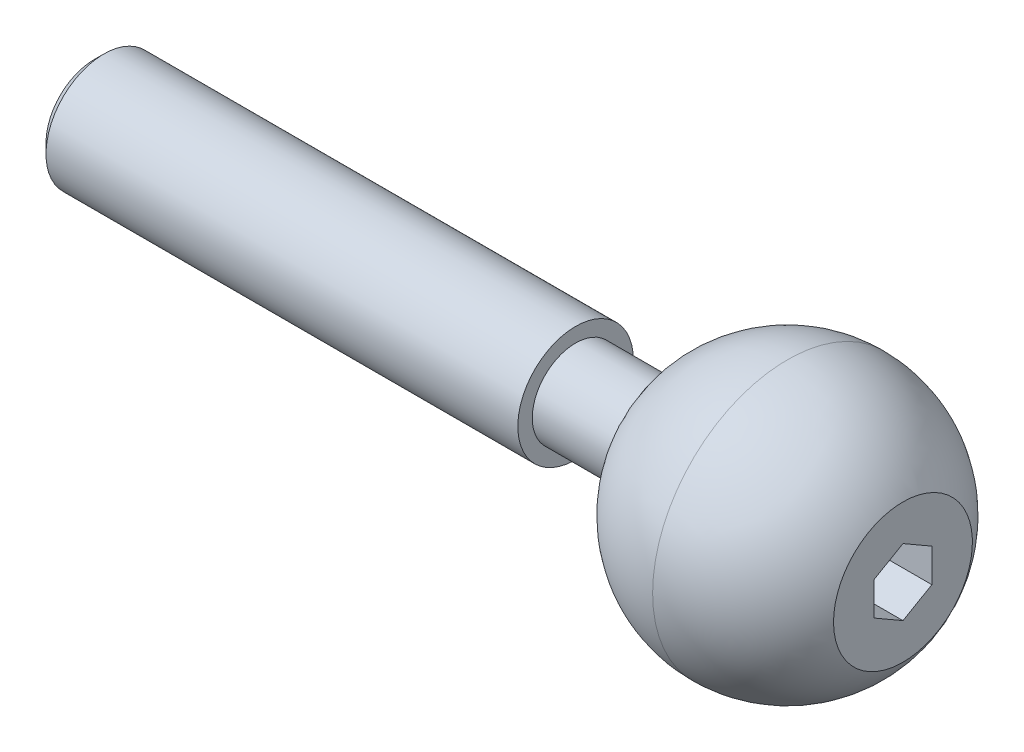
ISO-10303-21;
HEADER;
FILE_DESCRIPTION(('STEP AP214'),'2;1');
FILE_NAME('part.step','',(''),(''),'','','');
FILE_SCHEMA(('AUTOMOTIVE_DESIGN { 1 0 10303 214 1 1 1 1 }'));
ENDSEC;
DATA;
#1=APPLICATION_CONTEXT('core data for automotive mechanical design processes');
#2=APPLICATION_PROTOCOL_DEFINITION('international standard','automotive_design',2000,#1);
#3=PRODUCT_CONTEXT('',#1,'mechanical');
#4=PRODUCT('Part','Part','',(#3));
#5=PRODUCT_RELATED_PRODUCT_CATEGORY('part','',(#4));
#6=PRODUCT_DEFINITION_FORMATION('','',#4);
#7=PRODUCT_DEFINITION_CONTEXT('part definition',#1,'design');
#8=PRODUCT_DEFINITION('design','',#6,#7);
#9=PRODUCT_DEFINITION_SHAPE('','',#8);
#10=(LENGTH_UNIT() NAMED_UNIT(*) SI_UNIT(.MILLI.,.METRE.));
#11=(NAMED_UNIT(*) PLANE_ANGLE_UNIT() SI_UNIT($,.RADIAN.));
#12=(NAMED_UNIT(*) SI_UNIT($,.STERADIAN.) SOLID_ANGLE_UNIT());
#13=UNCERTAINTY_MEASURE_WITH_UNIT(LENGTH_MEASURE(1.E-05),#10,'distance_accuracy_value','');
#14=(GEOMETRIC_REPRESENTATION_CONTEXT(3) GLOBAL_UNCERTAINTY_ASSIGNED_CONTEXT((#13)) GLOBAL_UNIT_ASSIGNED_CONTEXT((#10,
#11,#12)) REPRESENTATION_CONTEXT('',''));
#15=CARTESIAN_POINT('',(0.,0.,0.));
#16=DIRECTION('',(0.,0.,1.));
#17=DIRECTION('',(1.,0.,0.));
#18=AXIS2_PLACEMENT_3D('',#15,#16,#17);
#19=CARTESIAN_POINT('',(6.,-0.8660254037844,-1.5));
#20=DIRECTION('',(0.,0.,-1.));
#21=DIRECTION('',(-1.,0.,0.));
#22=AXIS2_PLACEMENT_3D('',#19,#20,#21);
#23=PLANE('',#22);
#24=DIRECTION('',(0.,1.,0.));
#25=VECTOR('',#24,1.);
#26=CARTESIAN_POINT('',(6.,-0.8660254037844,-1.5));
#27=LINE('',#26,#25);
#28=CARTESIAN_POINT('',(6.,0.8660254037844,-1.5));
#29=VERTEX_POINT('',#28);
#30=CARTESIAN_POINT('',(6.,-0.866025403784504,-1.5));
#31=VERTEX_POINT('',#30);
#32=EDGE_CURVE('E74',#29,#31,#27,.F.);
#33=ORIENTED_EDGE('',*,*,#32,.F.);
#34=DIRECTION('',(1.,0.,0.));
#35=VECTOR('',#34,1.);
#36=CARTESIAN_POINT('',(6.,0.8660254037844,-1.5));
#37=LINE('',#36,#35);
#38=CARTESIAN_POINT('',(1.,0.8660254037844,-1.5));
#39=VERTEX_POINT('',#38);
#40=EDGE_CURVE('E98',#29,#39,#37,.F.);
#41=ORIENTED_EDGE('',*,*,#40,.T.);
#42=DIRECTION('',(0.,1.,0.));
#43=VECTOR('',#42,1.);
#44=CARTESIAN_POINT('',(1.,-0.8660254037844,-1.5));
#45=LINE('',#44,#43);
#46=CARTESIAN_POINT('',(1.,-0.866025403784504,-1.5));
#47=VERTEX_POINT('',#46);
#48=EDGE_CURVE('E87',#47,#39,#45,.T.);
#49=ORIENTED_EDGE('',*,*,#48,.F.);
#50=DIRECTION('',(1.,0.,0.));
#51=VECTOR('',#50,1.);
#52=CARTESIAN_POINT('',(6.,-0.866025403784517,-1.50000000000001));
#53=LINE('',#52,#51);
#54=EDGE_CURVE('E86',#47,#31,#53,.T.);
#55=ORIENTED_EDGE('',*,*,#54,.T.);
#56=EDGE_LOOP('',(#33,#41,#49,#55));
#57=FACE_BOUND('',#56,.T.);
#58=ADVANCED_FACE('F16',(#57),#23,.F.);
#59=CARTESIAN_POINT('',(-36.,0.,0.));
#60=DIRECTION('',(1.,0.,0.));
#61=DIRECTION('',(0.,0.,-1.));
#62=AXIS2_PLACEMENT_3D('',#59,#60,#61);
#63=PLANE('',#62);
#64=CARTESIAN_POINT('',(-36.0000000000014,0.,0.));
#65=DIRECTION('',(1.,0.,0.));
#66=DIRECTION('',(0.,0.,-1.));
#67=AXIS2_PLACEMENT_3D('',#64,#65,#66);
#68=CIRCLE('',#67,2.49997237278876);
#69=CARTESIAN_POINT('',(-36.0000000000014,0.,-2.49997237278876));
#70=VERTEX_POINT('',#69);
#71=EDGE_CURVE('E22',#70,#70,#68,.T.);
#72=ORIENTED_EDGE('',*,*,#71,.F.);
#73=EDGE_LOOP('',(#72));
#74=FACE_BOUND('',#73,.T.);
#75=ADVANCED_FACE('F193',(#74),#63,.F.);
#76=CARTESIAN_POINT('',(6.,-1.732050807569,0.));
#77=DIRECTION('',(0.,-0.866025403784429,-0.500000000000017));
#78=DIRECTION('',(0.,0.500000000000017,-0.866025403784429));
#79=AXIS2_PLACEMENT_3D('',#76,#77,#78);
#80=PLANE('',#79);
#81=DIRECTION('',(0.,0.500000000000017,-0.866025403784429));
#82=VECTOR('',#81,1.);
#83=CARTESIAN_POINT('',(6.,-1.732050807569,0.));
#84=LINE('',#83,#82);
#85=CARTESIAN_POINT('',(6.,-1.73205080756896,0.));
#86=VERTEX_POINT('',#85);
#87=EDGE_CURVE('E79',#31,#86,#84,.F.);
#88=ORIENTED_EDGE('',*,*,#87,.F.);
#89=ORIENTED_EDGE('',*,*,#54,.F.);
#90=DIRECTION('',(0.,0.500000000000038,-0.866025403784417));
#91=VECTOR('',#90,1.);
#92=CARTESIAN_POINT('',(1.,-1.732050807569,0.));
#93=LINE('',#92,#91);
#94=CARTESIAN_POINT('',(1.,-1.73205080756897,0.));
#95=VERTEX_POINT('',#94);
#96=EDGE_CURVE('E106',#95,#47,#93,.T.);
#97=ORIENTED_EDGE('',*,*,#96,.F.);
#98=DIRECTION('',(1.,0.,0.));
#99=VECTOR('',#98,1.);
#100=CARTESIAN_POINT('',(6.,-1.73205080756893,0.));
#101=LINE('',#100,#99);
#102=EDGE_CURVE('E95',#95,#86,#101,.T.);
#103=ORIENTED_EDGE('',*,*,#102,.T.);
#104=EDGE_LOOP('',(#88,#89,#97,#103));
#105=FACE_BOUND('',#104,.T.);
#106=ADVANCED_FACE('F93',(#105),#80,.F.);
#107=CARTESIAN_POINT('',(6.,0.8660254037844,-1.5));
#108=DIRECTION('',(0.,0.866025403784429,-0.500000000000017));
#109=DIRECTION('',(0.,0.500000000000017,0.866025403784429));
#110=AXIS2_PLACEMENT_3D('',#107,#108,#109);
#111=PLANE('',#110);
#112=DIRECTION('',(0.,0.500000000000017,0.866025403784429));
#113=VECTOR('',#112,1.);
#114=CARTESIAN_POINT('',(6.,0.8660254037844,-1.5));
#115=LINE('',#114,#113);
#116=CARTESIAN_POINT('',(6.,1.73205080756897,0.));
#117=VERTEX_POINT('',#116);
#118=EDGE_CURVE('E82',#117,#29,#115,.F.);
#119=ORIENTED_EDGE('',*,*,#118,.F.);
#120=DIRECTION('',(1.,0.,0.));
#121=VECTOR('',#120,1.);
#122=CARTESIAN_POINT('',(6.,1.73205080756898,0.));
#123=LINE('',#122,#121);
#124=CARTESIAN_POINT('',(1.,1.73205080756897,0.));
#125=VERTEX_POINT('',#124);
#126=EDGE_CURVE('E114',#117,#125,#123,.F.);
#127=ORIENTED_EDGE('',*,*,#126,.T.);
#128=DIRECTION('',(0.,0.500000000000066,0.866025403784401));
#129=VECTOR('',#128,1.);
#130=CARTESIAN_POINT('',(1.,0.8660254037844,-1.5));
#131=LINE('',#130,#129);
#132=EDGE_CURVE('E103',#39,#125,#131,.T.);
#133=ORIENTED_EDGE('',*,*,#132,.F.);
#134=ORIENTED_EDGE('',*,*,#40,.F.);
#135=EDGE_LOOP('',(#119,#127,#133,#134));
#136=FACE_BOUND('',#135,.T.);
#137=ADVANCED_FACE('F186',(#136),#111,.F.);
#138=CARTESIAN_POINT('',(-35.4999668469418,0.,0.));
#139=DIRECTION('',(1.,0.,0.));
#140=DIRECTION('',(0.,0.,-1.));
#141=AXIS2_PLACEMENT_3D('',#138,#139,#140);
#142=CONICAL_SURFACE('',#141,2.9999999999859,0.785392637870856);
#143=CARTESIAN_POINT('',(-35.499966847,0.,0.));
#144=DIRECTION('',(1.,0.,0.));
#145=DIRECTION('',(0.,0.,-1.));
#146=AXIS2_PLACEMENT_3D('',#143,#144,#145);
#147=CIRCLE('',#146,3.);
#148=CARTESIAN_POINT('',(-35.499966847,0.,-3.));
#149=VERTEX_POINT('',#148);
#150=EDGE_CURVE('E117',#149,#149,#147,.T.);
#151=ORIENTED_EDGE('',*,*,#150,.F.);
#152=EDGE_LOOP('',(#151));
#153=FACE_BOUND('',#152,.T.);
#154=ORIENTED_EDGE('',*,*,#71,.T.);
#155=EDGE_LOOP('',(#154));
#156=FACE_BOUND('',#155,.T.);
#157=ADVANCED_FACE('F182',(#153,#156),#142,.T.);
#158=CARTESIAN_POINT('',(1.,0.,0.));
#159=DIRECTION('',(1.,0.,0.));
#160=DIRECTION('',(0.,0.,-1.));
#161=AXIS2_PLACEMENT_3D('',#158,#159,#160);
#162=PLANE('',#161);
#163=ORIENTED_EDGE('',*,*,#48,.T.);
#164=ORIENTED_EDGE('',*,*,#132,.T.);
#165=DIRECTION('',(0.,-0.500000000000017,0.866025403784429));
#166=VECTOR('',#165,1.);
#167=CARTESIAN_POINT('',(1.,1.732050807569,0.));
#168=LINE('',#167,#166);
#169=CARTESIAN_POINT('',(1.,0.866025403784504,1.5));
#170=VERTEX_POINT('',#169);
#171=EDGE_CURVE('E110',#125,#170,#168,.T.);
#172=ORIENTED_EDGE('',*,*,#171,.T.);
#173=DIRECTION('',(0.,1.,0.));
#174=VECTOR('',#173,1.);
#175=CARTESIAN_POINT('',(1.,0.8660254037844,1.5));
#176=LINE('',#175,#174);
#177=CARTESIAN_POINT('',(1.,-0.8660254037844,1.5));
#178=VERTEX_POINT('',#177);
#179=EDGE_CURVE('E128',#170,#178,#176,.F.);
#180=ORIENTED_EDGE('',*,*,#179,.T.);
#181=DIRECTION('',(0.,-0.500000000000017,-0.866025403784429));
#182=VECTOR('',#181,1.);
#183=CARTESIAN_POINT('',(1.,-0.8660254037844,1.5));
#184=LINE('',#183,#182);
#185=EDGE_CURVE('E105',#178,#95,#184,.T.);
#186=ORIENTED_EDGE('',*,*,#185,.T.);
#187=ORIENTED_EDGE('',*,*,#96,.T.);
#188=EDGE_LOOP('',(#163,#164,#172,#180,#186,#187));
#189=FACE_BOUND('',#188,.T.);
#190=ADVANCED_FACE('F178',(#189),#162,.T.);
#191=CARTESIAN_POINT('',(6.,-0.8660254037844,1.5));
#192=DIRECTION('',(0.,-0.866025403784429,0.500000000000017));
#193=DIRECTION('',(0.,-0.500000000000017,-0.866025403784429));
#194=AXIS2_PLACEMENT_3D('',#191,#192,#193);
#195=PLANE('',#194);
#196=DIRECTION('',(0.,-0.500000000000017,-0.866025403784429));
#197=VECTOR('',#196,1.);
#198=CARTESIAN_POINT('',(6.,-0.8660254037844,1.5));
#199=LINE('',#198,#197);
#200=CARTESIAN_POINT('',(6.,-0.8660254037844,1.5));
#201=VERTEX_POINT('',#200);
#202=EDGE_CURVE('E108',#86,#201,#199,.F.);
#203=ORIENTED_EDGE('',*,*,#202,.F.);
#204=ORIENTED_EDGE('',*,*,#102,.F.);
#205=ORIENTED_EDGE('',*,*,#185,.F.);
#206=DIRECTION('',(1.,0.,0.));
#207=VECTOR('',#206,1.);
#208=CARTESIAN_POINT('',(6.,-0.8660254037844,1.5));
#209=LINE('',#208,#207);
#210=EDGE_CURVE('E125',#178,#201,#209,.T.);
#211=ORIENTED_EDGE('',*,*,#210,.T.);
#212=EDGE_LOOP('',(#203,#204,#205,#211));
#213=FACE_BOUND('',#212,.T.);
#214=ADVANCED_FACE('F174',(#213),#195,.F.);
#215=CARTESIAN_POINT('',(6.,1.732050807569,0.));
#216=DIRECTION('',(0.,0.866025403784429,0.500000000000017));
#217=DIRECTION('',(0.,-0.500000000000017,0.866025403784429));
#218=AXIS2_PLACEMENT_3D('',#215,#216,#217);
#219=PLANE('',#218);
#220=DIRECTION('',(0.,-0.500000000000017,0.866025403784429));
#221=VECTOR('',#220,1.);
#222=CARTESIAN_POINT('',(6.,1.732050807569,0.));
#223=LINE('',#222,#221);
#224=CARTESIAN_POINT('',(6.,0.866025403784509,1.50000000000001));
#225=VERTEX_POINT('',#224);
#226=EDGE_CURVE('E118',#225,#117,#223,.F.);
#227=ORIENTED_EDGE('',*,*,#226,.F.);
#228=DIRECTION('',(1.,0.,0.));
#229=VECTOR('',#228,1.);
#230=CARTESIAN_POINT('',(6.,0.8660254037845,1.5));
#231=LINE('',#230,#229);
#232=EDGE_CURVE('E121',#225,#170,#231,.F.);
#233=ORIENTED_EDGE('',*,*,#232,.T.);
#234=ORIENTED_EDGE('',*,*,#171,.F.);
#235=ORIENTED_EDGE('',*,*,#126,.F.);
#236=EDGE_LOOP('',(#227,#233,#234,#235));
#237=FACE_BOUND('',#236,.T.);
#238=ADVANCED_FACE('F170',(#237),#219,.F.);
#239=CARTESIAN_POINT('',(0.,0.,0.));
#240=DIRECTION('',(1.,0.,0.));
#241=DIRECTION('',(0.,0.,-1.));
#242=AXIS2_PLACEMENT_3D('',#239,#240,#241);
#243=CYLINDRICAL_SURFACE('',#242,3.);
#244=CARTESIAN_POINT('',(-11.,0.,0.));
#245=DIRECTION('',(1.,0.,0.));
#246=DIRECTION('',(0.,0.,-1.));
#247=AXIS2_PLACEMENT_3D('',#244,#245,#246);
#248=CIRCLE('',#247,3.);
#249=CARTESIAN_POINT('',(-11.,0.,-3.));
#250=VERTEX_POINT('',#249);
#251=EDGE_CURVE('E124',#250,#250,#248,.F.);
#252=ORIENTED_EDGE('',*,*,#251,.T.);
#253=EDGE_LOOP('',(#252));
#254=FACE_BOUND('',#253,.T.);
#255=ORIENTED_EDGE('',*,*,#150,.T.);
#256=EDGE_LOOP('',(#255));
#257=FACE_BOUND('',#256,.T.);
#258=ADVANCED_FACE('F166',(#254,#257),#243,.T.);
#259=CARTESIAN_POINT('',(6.,0.8660254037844,1.5));
#260=DIRECTION('',(0.,0.,1.));
#261=DIRECTION('',(1.,0.,0.));
#262=AXIS2_PLACEMENT_3D('',#259,#260,#261);
#263=PLANE('',#262);
#264=DIRECTION('',(0.,1.,0.));
#265=VECTOR('',#264,1.);
#266=CARTESIAN_POINT('',(6.,0.,1.5));
#267=LINE('',#266,#265);
#268=EDGE_CURVE('E130',#201,#225,#267,.T.);
#269=ORIENTED_EDGE('',*,*,#268,.F.);
#270=ORIENTED_EDGE('',*,*,#210,.F.);
#271=ORIENTED_EDGE('',*,*,#179,.F.);
#272=ORIENTED_EDGE('',*,*,#232,.F.);
#273=EDGE_LOOP('',(#269,#270,#271,#272));
#274=FACE_BOUND('',#273,.T.);
#275=ADVANCED_FACE('F162',(#274),#263,.F.);
#276=CARTESIAN_POINT('',(-11.,0.,0.));
#277=DIRECTION('',(-1.,0.,0.));
#278=DIRECTION('',(0.,0.,1.));
#279=AXIS2_PLACEMENT_3D('',#276,#277,#278);
#280=PLANE('',#279);
#281=CARTESIAN_POINT('',(-11.,0.,0.));
#282=DIRECTION('',(-1.,0.,0.));
#283=DIRECTION('',(0.,0.,1.));
#284=AXIS2_PLACEMENT_3D('',#281,#282,#283);
#285=CIRCLE('',#284,2.25);
#286=CARTESIAN_POINT('',(-11.,0.,2.25));
#287=VERTEX_POINT('',#286);
#288=EDGE_CURVE('E133',#287,#287,#285,.F.);
#289=ORIENTED_EDGE('',*,*,#288,.F.);
#290=EDGE_LOOP('',(#289));
#291=FACE_BOUND('',#290,.T.);
#292=ORIENTED_EDGE('',*,*,#251,.F.);
#293=EDGE_LOOP('',(#292));
#294=FACE_BOUND('',#293,.T.);
#295=ADVANCED_FACE('F159',(#291,#294),#280,.F.);
#296=CARTESIAN_POINT('',(6.,0.,0.));
#297=DIRECTION('',(1.,0.,0.));
#298=DIRECTION('',(0.,0.,-1.));
#299=AXIS2_PLACEMENT_3D('',#296,#297,#298);
#300=PLANE('',#299);
#301=ORIENTED_EDGE('',*,*,#202,.T.);
#302=ORIENTED_EDGE('',*,*,#268,.T.);
#303=ORIENTED_EDGE('',*,*,#226,.T.);
#304=ORIENTED_EDGE('',*,*,#118,.T.);
#305=ORIENTED_EDGE('',*,*,#32,.T.);
#306=ORIENTED_EDGE('',*,*,#87,.T.);
#307=EDGE_LOOP('',(#301,#302,#303,#304,#305,#306));
#308=FACE_BOUND('',#307,.T.);
#309=CARTESIAN_POINT('',(6.,3.60555127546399,0.));
#310=CARTESIAN_POINT('',(6.,3.60555066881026,-0.101232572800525));
#311=CARTESIAN_POINT('',(6.,3.60128402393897,-0.202483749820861));
#312=CARTESIAN_POINT('',(6.,3.58424518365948,-0.40428639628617));
#313=CARTESIAN_POINT('',(6.,3.57147047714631,-0.50483765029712));
#314=CARTESIAN_POINT('',(6.,3.53747298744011,-0.704675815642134));
#315=CARTESIAN_POINT('',(6.,3.51623679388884,-0.803960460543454));
#316=CARTESIAN_POINT('',(6.,3.46546271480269,-1.00044304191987));
#317=CARTESIAN_POINT('',(6.,3.43591809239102,-1.0976392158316));
#318=CARTESIAN_POINT('',(6.,3.33523005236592,-1.38463770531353));
#319=CARTESIAN_POINT('',(6.,3.2519497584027,-1.57033298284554));
#320=CARTESIAN_POINT('',(6.,3.05535147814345,-1.92508560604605));
#321=CARTESIAN_POINT('',(6.,2.94203234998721,-2.09414231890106));
#322=CARTESIAN_POINT('',(6.,2.7521043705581,-2.33157545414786));
#323=CARTESIAN_POINT('',(6.,2.68542001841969,-2.40807257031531));
#324=CARTESIAN_POINT('',(6.,2.5458966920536,-2.55512453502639));
#325=CARTESIAN_POINT('',(6.,2.47306371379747,-2.62568504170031));
#326=CARTESIAN_POINT('',(6.,2.32167761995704,-2.76045045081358));
#327=CARTESIAN_POINT('',(6.,2.24312192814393,-2.8246524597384));
#328=CARTESIAN_POINT('',(6.,2.08088843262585,-2.94621700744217));
#329=CARTESIAN_POINT('',(6.,1.99720944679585,-3.00357795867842));
#330=CARTESIAN_POINT('',(6.,1.73939997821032,-3.16472074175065));
#331=CARTESIAN_POINT('',(6.,1.55833699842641,-3.25770466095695));
#332=CARTESIAN_POINT('',(6.,1.18326789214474,-3.41189822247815));
#333=CARTESIAN_POINT('',(6.,0.989261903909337,-3.47310820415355));
#334=CARTESIAN_POINT('',(6.,0.593702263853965,-3.5621049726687));
#335=CARTESIAN_POINT('',(6.,0.392148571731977,-3.58989158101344));
#336=CARTESIAN_POINT('',(6.,-0.0127627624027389,-3.61122405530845));
#337=CARTESIAN_POINT('',(6.,-0.216120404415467,-3.60476992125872));
#338=CARTESIAN_POINT('',(6.,-0.618841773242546,-3.55783003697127));
#339=CARTESIAN_POINT('',(6.,-0.81820552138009,-3.51734446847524));
#340=CARTESIAN_POINT('',(6.,-1.20740047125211,-3.40341563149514));
#341=CARTESIAN_POINT('',(6.,-1.39723157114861,-3.32997201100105));
#342=CARTESIAN_POINT('',(6.,-1.67054622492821,-3.19681113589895));
#343=CARTESIAN_POINT('',(6.,-1.75978928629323,-3.14856046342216));
#344=CARTESIAN_POINT('',(6.,-1.93389830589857,-3.04471588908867));
#345=CARTESIAN_POINT('',(6.,-2.01876527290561,-2.9891236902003));
#346=CARTESIAN_POINT('',(6.,-2.18347404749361,-2.8710115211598));
#347=CARTESIAN_POINT('',(6.,-2.2633181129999,-2.80849469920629));
#348=CARTESIAN_POINT('',(6.,-2.41752082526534,-2.67691748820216));
#349=CARTESIAN_POINT('',(6.,-2.49187410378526,-2.60785084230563));
#350=CARTESIAN_POINT('',(6.,-2.70569941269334,-2.39168917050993));
#351=CARTESIAN_POINT('',(6.,-2.83615518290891,-2.23547556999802));
#352=CARTESIAN_POINT('',(6.,-3.0689414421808,-1.90334477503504));
#353=CARTESIAN_POINT('',(6.,-3.17127300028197,-1.72742832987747));
#354=CARTESIAN_POINT('',(6.,-3.30156057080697,-1.45259863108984));
#355=CARTESIAN_POINT('',(6.,-3.34115471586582,-1.35904498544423));
#356=CARTESIAN_POINT('',(6.,-3.41229350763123,-1.16898529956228));
#357=CARTESIAN_POINT('',(6.,-3.44384466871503,-1.07248172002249));
#358=CARTESIAN_POINT('',(6.,-3.49865233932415,-0.877322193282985));
#359=CARTESIAN_POINT('',(6.,-3.52192194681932,-0.778669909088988));
#360=CARTESIAN_POINT('',(6.,-3.56007127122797,-0.579774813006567));
#361=CARTESIAN_POINT('',(6.,-3.57495346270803,-0.47953247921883));
#362=CARTESIAN_POINT('',(6.,-3.59223934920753,-0.315945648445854));
#363=CARTESIAN_POINT('',(6.,-3.5972297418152,-0.252863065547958));
#364=CARTESIAN_POINT('',(6.,-3.60388589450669,-0.126522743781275));
#365=CARTESIAN_POINT('',(6.,-3.60555165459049,-0.0632650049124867));
#366=CARTESIAN_POINT('',(6.,-3.60555066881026,0.101232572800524));
#367=CARTESIAN_POINT('',(6.,-3.60128402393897,0.20248374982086));
#368=CARTESIAN_POINT('',(6.,-3.58424518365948,0.404286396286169));
#369=CARTESIAN_POINT('',(6.,-3.57147047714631,0.504837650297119));
#370=CARTESIAN_POINT('',(6.,-3.53747298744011,0.704675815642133));
#371=CARTESIAN_POINT('',(6.,-3.51623679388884,0.803960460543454));
#372=CARTESIAN_POINT('',(6.,-3.46546271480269,1.00044304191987));
#373=CARTESIAN_POINT('',(6.,-3.43591809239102,1.09763921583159));
#374=CARTESIAN_POINT('',(6.,-3.33523005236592,1.38463770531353));
#375=CARTESIAN_POINT('',(6.,-3.2519497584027,1.57033298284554));
#376=CARTESIAN_POINT('',(6.,-3.05535147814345,1.92508560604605));
#377=CARTESIAN_POINT('',(6.,-2.94203234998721,2.09414231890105));
#378=CARTESIAN_POINT('',(6.,-2.7521043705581,2.33157545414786));
#379=CARTESIAN_POINT('',(6.,-2.68542001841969,2.40807257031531));
#380=CARTESIAN_POINT('',(6.,-2.5458966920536,2.55512453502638));
#381=CARTESIAN_POINT('',(6.,-2.47306371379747,2.62568504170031));
#382=CARTESIAN_POINT('',(6.,-2.32167761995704,2.76045045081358));
#383=CARTESIAN_POINT('',(6.,-2.24312192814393,2.8246524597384));
#384=CARTESIAN_POINT('',(6.,-2.08088843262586,2.94621700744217));
#385=CARTESIAN_POINT('',(6.,-1.99720944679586,3.00357795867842));
#386=CARTESIAN_POINT('',(6.,-1.73939997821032,3.16472074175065));
#387=CARTESIAN_POINT('',(6.,-1.55833699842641,3.25770466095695));
#388=CARTESIAN_POINT('',(6.,-1.18326789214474,3.41189822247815));
#389=CARTESIAN_POINT('',(6.,-0.989261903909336,3.47310820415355));
#390=CARTESIAN_POINT('',(6.,-0.593702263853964,3.5621049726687));
#391=CARTESIAN_POINT('',(6.,-0.392148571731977,3.58989158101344));
#392=CARTESIAN_POINT('',(6.,0.0127627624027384,3.61122405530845));
#393=CARTESIAN_POINT('',(6.,0.216120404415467,3.60476992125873));
#394=CARTESIAN_POINT('',(6.,0.618841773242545,3.55783003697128));
#395=CARTESIAN_POINT('',(6.,0.818205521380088,3.51734446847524));
#396=CARTESIAN_POINT('',(6.,1.20740047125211,3.40341563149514));
#397=CARTESIAN_POINT('',(6.,1.39723157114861,3.32997201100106));
#398=CARTESIAN_POINT('',(6.,1.67054622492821,3.19681113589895));
#399=CARTESIAN_POINT('',(6.,1.75978928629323,3.14856046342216));
#400=CARTESIAN_POINT('',(6.,1.93389830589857,3.04471588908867));
#401=CARTESIAN_POINT('',(6.,2.01876527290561,2.9891236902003));
#402=CARTESIAN_POINT('',(6.,2.18347404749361,2.8710115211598));
#403=CARTESIAN_POINT('',(6.,2.2633181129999,2.80849469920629));
#404=CARTESIAN_POINT('',(6.,2.41752082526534,2.67691748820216));
#405=CARTESIAN_POINT('',(6.,2.49187410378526,2.60785084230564));
#406=CARTESIAN_POINT('',(6.,2.70569941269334,2.39168917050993));
#407=CARTESIAN_POINT('',(6.,2.8361551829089,2.23547556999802));
#408=CARTESIAN_POINT('',(6.,3.0689414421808,1.90334477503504));
#409=CARTESIAN_POINT('',(6.,3.17127300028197,1.72742832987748));
#410=CARTESIAN_POINT('',(6.,3.30156057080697,1.45259863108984));
#411=CARTESIAN_POINT('',(6.,3.34115471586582,1.35904498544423));
#412=CARTESIAN_POINT('',(6.,3.41229350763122,1.16898529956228));
#413=CARTESIAN_POINT('',(6.,3.44384466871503,1.07248172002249));
#414=CARTESIAN_POINT('',(6.,3.49865233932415,0.877322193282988));
#415=CARTESIAN_POINT('',(6.,3.52192194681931,0.778669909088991));
#416=CARTESIAN_POINT('',(6.,3.56007127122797,0.57977481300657));
#417=CARTESIAN_POINT('',(6.,3.57495346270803,0.479532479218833));
#418=CARTESIAN_POINT('',(6.,3.59223934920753,0.315945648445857));
#419=CARTESIAN_POINT('',(6.,3.5972297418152,0.252863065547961));
#420=CARTESIAN_POINT('',(6.,3.60388589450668,0.126522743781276));
#421=CARTESIAN_POINT('',(6.,3.60555165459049,0.0632650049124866));
#422=CARTESIAN_POINT('',(6.,3.60555127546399,0.));
#423=B_SPLINE_CURVE_WITH_KNOTS('',3,(#309,#310,#311,#312,#313,#314,#315,#316,#317,#318,#319,
#320,#321,#322,#323,#324,#325,#326,#327,#328,#329,#330,#331,#332,#333,#334,#335,#336,#337,#338,
#339,#340,#341,#342,#343,#344,#345,#346,#347,#348,#349,#350,#351,#352,#353,#354,#355,#356,#357,
#358,#359,#360,#361,#362,#363,#364,#365,#366,#367,#368,#369,#370,#371,#372,#373,#374,#375,#376,
#377,#378,#379,#380,#381,#382,#383,#384,#385,#386,#387,#388,#389,#390,#391,#392,#393,#394,#395,
#396,#397,#398,#399,#400,#401,#402,#403,#404,#405,#406,#407,#408,#409,#410,#411,#412,#413,#414,
#415,#416,#417,#418,#419,#420,#421,#422),.UNSPECIFIED.,.T.,.F.,(4,2,2,2,2,2,2,2,2,2,2,2,2,2,2,2,
2,2,2,2,2,2,2,2,2,2,2,2,2,2,2,2,2,2,2,2,2,2,2,2,2,2,2,2,2,2,2,2,2,2,2,2,2,2,2,2,4),(0.,
0.303639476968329,0.607368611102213,0.911581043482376,1.21604086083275,1.82350917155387,
2.43100057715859,2.73514430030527,3.03899478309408,3.34298290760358,3.64704143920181,
4.25452454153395,4.86200115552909,5.4694810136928,6.0769608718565,6.68443748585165,
7.29192058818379,7.59597911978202,7.89996724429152,8.20381772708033,8.50796145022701,
9.11545285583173,9.72292116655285,10.0273809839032,10.3315934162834,10.6353225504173,
10.9389620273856,11.128720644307,11.3184792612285,11.6221187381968,11.9258478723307,
12.2300603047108,12.5345201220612,13.1419884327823,13.7494798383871,14.0536235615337,
14.3574740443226,14.661462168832,14.9655207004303,15.5730038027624,16.1804804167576,
16.7879602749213,17.395440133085,18.0029167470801,18.6103998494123,18.9144583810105,
19.21844650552,19.5222969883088,19.8264407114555,20.4339321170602,21.0414004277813,
21.3458602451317,21.6500726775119,21.9538018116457,22.2574412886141,22.4471999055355,
22.636958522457),.UNSPECIFIED.);
#424=CARTESIAN_POINT('',(6.,3.60555127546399,0.));
#425=VERTEX_POINT('',#424);
#426=EDGE_CURVE('E148',#425,#425,#423,.T.);
#427=ORIENTED_EDGE('',*,*,#426,.F.);
#428=EDGE_LOOP('',(#427));
#429=FACE_BOUND('',#428,.T.);
#430=ADVANCED_FACE('F76',(#308,#429),#300,.T.);
#431=CARTESIAN_POINT('',(-6.,0.,0.));
#432=DIRECTION('',(-1.,0.,0.));
#433=DIRECTION('',(0.,0.,1.));
#434=AXIS2_PLACEMENT_3D('',#431,#432,#433);
#435=CYLINDRICAL_SURFACE('',#434,2.25);
#436=ORIENTED_EDGE('',*,*,#288,.T.);
#437=EDGE_LOOP('',(#436));
#438=FACE_BOUND('',#437,.T.);
#439=CARTESIAN_POINT('',(-6.,0.,0.));
#440=DIRECTION('',(-1.,0.,0.));
#441=DIRECTION('',(0.,0.,1.));
#442=AXIS2_PLACEMENT_3D('',#439,#440,#441);
#443=CIRCLE('',#442,2.25);
#444=CARTESIAN_POINT('',(-6.,0.,2.25));
#445=VERTEX_POINT('',#444);
#446=EDGE_CURVE('E154',#445,#445,#443,.T.);
#447=ORIENTED_EDGE('',*,*,#446,.T.);
#448=EDGE_LOOP('',(#447));
#449=FACE_BOUND('',#448,.T.);
#450=ADVANCED_FACE('F143',(#438,#449),#435,.T.);
#451=CARTESIAN_POINT('',(0.,0.,0.));
#452=DIRECTION('',(0.,0.,-1.));
#453=DIRECTION('',(-1.,0.,0.));
#454=AXIS2_PLACEMENT_3D('',#451,#452,#453);
#455=SPHERICAL_SURFACE('',#454,7.);
#456=ORIENTED_EDGE('',*,*,#426,.T.);
#457=EDGE_LOOP('',(#456));
#458=FACE_BOUND('',#457,.T.);
#459=CARTESIAN_POINT('',(0.,0.,0.));
#460=DIRECTION('',(-1.,0.,0.));
#461=DIRECTION('',(0.,0.,1.));
#462=AXIS2_PLACEMENT_3D('',#459,#460,#461);
#463=CIRCLE('',#462,7.);
#464=CARTESIAN_POINT('',(0.,0.,7.));
#465=VERTEX_POINT('',#464);
#466=CARTESIAN_POINT('',(0.,0.,-7.));
#467=VERTEX_POINT('',#466);
#468=EDGE_CURVE('E28',#465,#467,#463,.T.);
#469=ORIENTED_EDGE('',*,*,#468,.F.);
#470=CARTESIAN_POINT('',(0.,0.,0.));
#471=DIRECTION('',(-1.,0.,0.));
#472=DIRECTION('',(0.,0.,-1.));
#473=AXIS2_PLACEMENT_3D('',#470,#471,#472);
#474=CIRCLE('',#473,7.);
#475=EDGE_CURVE('E34',#467,#465,#474,.T.);
#476=ORIENTED_EDGE('',*,*,#475,.F.);
#477=EDGE_LOOP('',(#469,#476));
#478=FACE_BOUND('',#477,.T.);
#479=ADVANCED_FACE('F138',(#458,#478),#455,.T.);
#480=CARTESIAN_POINT('',(-6.,0.,0.));
#481=DIRECTION('',(1.,0.,0.));
#482=DIRECTION('',(0.,0.,-1.));
#483=AXIS2_PLACEMENT_3D('',#480,#481,#482);
#484=PLANE('',#483);
#485=ORIENTED_EDGE('',*,*,#446,.F.);
#486=EDGE_LOOP('',(#485));
#487=FACE_BOUND('',#486,.T.);
#488=CARTESIAN_POINT('',(-6.,3.60555127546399,0.));
#489=CARTESIAN_POINT('',(-6.,3.60555066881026,0.101232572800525));
#490=CARTESIAN_POINT('',(-6.,3.60128402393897,0.202483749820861));
#491=CARTESIAN_POINT('',(-6.,3.58424518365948,0.40428639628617));
#492=CARTESIAN_POINT('',(-6.,3.57147047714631,0.50483765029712));
#493=CARTESIAN_POINT('',(-6.,3.53747298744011,0.704675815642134));
#494=CARTESIAN_POINT('',(-6.,3.51623679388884,0.803960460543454));
#495=CARTESIAN_POINT('',(-6.,3.46546271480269,1.00044304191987));
#496=CARTESIAN_POINT('',(-6.,3.43591809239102,1.0976392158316));
#497=CARTESIAN_POINT('',(-6.,3.33523005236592,1.38463770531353));
#498=CARTESIAN_POINT('',(-6.,3.2519497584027,1.57033298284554));
#499=CARTESIAN_POINT('',(-6.,3.05535147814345,1.92508560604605));
#500=CARTESIAN_POINT('',(-6.,2.94203234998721,2.09414231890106));
#501=CARTESIAN_POINT('',(-6.,2.7521043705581,2.33157545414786));
#502=CARTESIAN_POINT('',(-6.,2.68542001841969,2.40807257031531));
#503=CARTESIAN_POINT('',(-6.,2.5458966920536,2.55512453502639));
#504=CARTESIAN_POINT('',(-6.,2.47306371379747,2.62568504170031));
#505=CARTESIAN_POINT('',(-6.,2.32167761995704,2.76045045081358));
#506=CARTESIAN_POINT('',(-6.,2.24312192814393,2.8246524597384));
#507=CARTESIAN_POINT('',(-6.,2.08088843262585,2.94621700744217));
#508=CARTESIAN_POINT('',(-6.,1.99720944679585,3.00357795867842));
#509=CARTESIAN_POINT('',(-6.,1.73939997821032,3.16472074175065));
#510=CARTESIAN_POINT('',(-6.,1.55833699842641,3.25770466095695));
#511=CARTESIAN_POINT('',(-6.,1.18326789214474,3.41189822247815));
#512=CARTESIAN_POINT('',(-6.,0.989261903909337,3.47310820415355));
#513=CARTESIAN_POINT('',(-6.,0.593702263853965,3.5621049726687));
#514=CARTESIAN_POINT('',(-6.,0.392148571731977,3.58989158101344));
#515=CARTESIAN_POINT('',(-6.,-0.0127627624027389,3.61122405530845));
#516=CARTESIAN_POINT('',(-6.,-0.216120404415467,3.60476992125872));
#517=CARTESIAN_POINT('',(-6.,-0.618841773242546,3.55783003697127));
#518=CARTESIAN_POINT('',(-6.,-0.81820552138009,3.51734446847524));
#519=CARTESIAN_POINT('',(-6.,-1.20740047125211,3.40341563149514));
#520=CARTESIAN_POINT('',(-6.00000000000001,-1.39723157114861,3.32997201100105));
#521=CARTESIAN_POINT('',(-6.,-1.67054622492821,3.19681113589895));
#522=CARTESIAN_POINT('',(-6.,-1.75978928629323,3.14856046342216));
#523=CARTESIAN_POINT('',(-6.,-1.93389830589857,3.04471588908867));
#524=CARTESIAN_POINT('',(-6.,-2.01876527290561,2.9891236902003));
#525=CARTESIAN_POINT('',(-6.,-2.18347404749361,2.8710115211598));
#526=CARTESIAN_POINT('',(-6.,-2.2633181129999,2.80849469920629));
#527=CARTESIAN_POINT('',(-6.,-2.41752082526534,2.67691748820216));
#528=CARTESIAN_POINT('',(-6.,-2.49187410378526,2.60785084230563));
#529=CARTESIAN_POINT('',(-6.,-2.70569941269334,2.39168917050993));
#530=CARTESIAN_POINT('',(-6.,-2.83615518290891,2.23547556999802));
#531=CARTESIAN_POINT('',(-6.,-3.0689414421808,1.90334477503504));
#532=CARTESIAN_POINT('',(-6.,-3.17127300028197,1.72742832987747));
#533=CARTESIAN_POINT('',(-6.,-3.30156057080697,1.45259863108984));
#534=CARTESIAN_POINT('',(-6.,-3.34115471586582,1.35904498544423));
#535=CARTESIAN_POINT('',(-6.,-3.41229350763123,1.16898529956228));
#536=CARTESIAN_POINT('',(-6.,-3.44384466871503,1.07248172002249));
#537=CARTESIAN_POINT('',(-6.,-3.49865233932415,0.877322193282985));
#538=CARTESIAN_POINT('',(-6.,-3.52192194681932,0.778669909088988));
#539=CARTESIAN_POINT('',(-6.,-3.56007127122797,0.579774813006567));
#540=CARTESIAN_POINT('',(-6.,-3.57495346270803,0.47953247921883));
#541=CARTESIAN_POINT('',(-6.,-3.59223934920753,0.315945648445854));
#542=CARTESIAN_POINT('',(-6.,-3.5972297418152,0.252863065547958));
#543=CARTESIAN_POINT('',(-6.,-3.60388589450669,0.126522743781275));
#544=CARTESIAN_POINT('',(-6.,-3.60555165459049,0.0632650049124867));
#545=CARTESIAN_POINT('',(-6.,-3.60555066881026,-0.101232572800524));
#546=CARTESIAN_POINT('',(-6.,-3.60128402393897,-0.20248374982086));
#547=CARTESIAN_POINT('',(-6.,-3.58424518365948,-0.404286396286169));
#548=CARTESIAN_POINT('',(-6.,-3.57147047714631,-0.504837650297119));
#549=CARTESIAN_POINT('',(-6.,-3.53747298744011,-0.704675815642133));
#550=CARTESIAN_POINT('',(-6.,-3.51623679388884,-0.803960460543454));
#551=CARTESIAN_POINT('',(-6.,-3.46546271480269,-1.00044304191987));
#552=CARTESIAN_POINT('',(-6.,-3.43591809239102,-1.09763921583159));
#553=CARTESIAN_POINT('',(-6.,-3.33523005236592,-1.38463770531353));
#554=CARTESIAN_POINT('',(-6.,-3.2519497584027,-1.57033298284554));
#555=CARTESIAN_POINT('',(-6.,-3.05535147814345,-1.92508560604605));
#556=CARTESIAN_POINT('',(-6.00000000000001,-2.94203234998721,-2.09414231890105));
#557=CARTESIAN_POINT('',(-6.,-2.7521043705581,-2.33157545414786));
#558=CARTESIAN_POINT('',(-6.,-2.68542001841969,-2.40807257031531));
#559=CARTESIAN_POINT('',(-6.,-2.5458966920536,-2.55512453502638));
#560=CARTESIAN_POINT('',(-6.,-2.47306371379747,-2.6256850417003));
#561=CARTESIAN_POINT('',(-6.,-2.32167761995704,-2.76045045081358));
#562=CARTESIAN_POINT('',(-6.,-2.24312192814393,-2.8246524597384));
#563=CARTESIAN_POINT('',(-6.,-2.08088843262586,-2.94621700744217));
#564=CARTESIAN_POINT('',(-6.,-1.99720944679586,-3.00357795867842));
#565=CARTESIAN_POINT('',(-6.,-1.73939997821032,-3.16472074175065));
#566=CARTESIAN_POINT('',(-6.,-1.55833699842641,-3.25770466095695));
#567=CARTESIAN_POINT('',(-6.,-1.18326789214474,-3.41189822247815));
#568=CARTESIAN_POINT('',(-6.,-0.989261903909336,-3.47310820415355));
#569=CARTESIAN_POINT('',(-6.,-0.593702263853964,-3.5621049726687));
#570=CARTESIAN_POINT('',(-6.,-0.392148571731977,-3.58989158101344));
#571=CARTESIAN_POINT('',(-6.,0.0127627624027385,-3.61122405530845));
#572=CARTESIAN_POINT('',(-6.,0.216120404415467,-3.60476992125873));
#573=CARTESIAN_POINT('',(-6.,0.618841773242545,-3.55783003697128));
#574=CARTESIAN_POINT('',(-6.,0.818205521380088,-3.51734446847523));
#575=CARTESIAN_POINT('',(-6.,1.20740047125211,-3.40341563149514));
#576=CARTESIAN_POINT('',(-6.,1.39723157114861,-3.32997201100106));
#577=CARTESIAN_POINT('',(-6.,1.67054622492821,-3.19681113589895));
#578=CARTESIAN_POINT('',(-6.,1.75978928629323,-3.14856046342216));
#579=CARTESIAN_POINT('',(-6.,1.93389830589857,-3.04471588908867));
#580=CARTESIAN_POINT('',(-6.,2.01876527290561,-2.9891236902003));
#581=CARTESIAN_POINT('',(-6.,2.18347404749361,-2.8710115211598));
#582=CARTESIAN_POINT('',(-6.,2.2633181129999,-2.80849469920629));
#583=CARTESIAN_POINT('',(-6.,2.41752082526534,-2.67691748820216));
#584=CARTESIAN_POINT('',(-6.,2.49187410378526,-2.60785084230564));
#585=CARTESIAN_POINT('',(-6.,2.70569941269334,-2.39168917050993));
#586=CARTESIAN_POINT('',(-6.,2.8361551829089,-2.23547556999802));
#587=CARTESIAN_POINT('',(-6.,3.0689414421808,-1.90334477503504));
#588=CARTESIAN_POINT('',(-6.,3.17127300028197,-1.72742832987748));
#589=CARTESIAN_POINT('',(-6.,3.30156057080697,-1.45259863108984));
#590=CARTESIAN_POINT('',(-6.,3.34115471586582,-1.35904498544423));
#591=CARTESIAN_POINT('',(-6.,3.41229350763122,-1.16898529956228));
#592=CARTESIAN_POINT('',(-6.,3.44384466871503,-1.07248172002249));
#593=CARTESIAN_POINT('',(-6.,3.49865233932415,-0.877322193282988));
#594=CARTESIAN_POINT('',(-6.,3.52192194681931,-0.778669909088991));
#595=CARTESIAN_POINT('',(-6.,3.56007127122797,-0.57977481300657));
#596=CARTESIAN_POINT('',(-6.,3.57495346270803,-0.479532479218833));
#597=CARTESIAN_POINT('',(-6.,3.59223934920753,-0.315945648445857));
#598=CARTESIAN_POINT('',(-6.,3.5972297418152,-0.252863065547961));
#599=CARTESIAN_POINT('',(-6.,3.60388589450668,-0.126522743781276));
#600=CARTESIAN_POINT('',(-6.,3.60555165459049,-0.0632650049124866));
#601=CARTESIAN_POINT('',(-6.,3.60555127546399,0.));
#602=B_SPLINE_CURVE_WITH_KNOTS('',3,(#488,#489,#490,#491,#492,#493,#494,#495,#496,#497,#498,
#499,#500,#501,#502,#503,#504,#505,#506,#507,#508,#509,#510,#511,#512,#513,#514,#515,#516,#517,
#518,#519,#520,#521,#522,#523,#524,#525,#526,#527,#528,#529,#530,#531,#532,#533,#534,#535,#536,
#537,#538,#539,#540,#541,#542,#543,#544,#545,#546,#547,#548,#549,#550,#551,#552,#553,#554,#555,
#556,#557,#558,#559,#560,#561,#562,#563,#564,#565,#566,#567,#568,#569,#570,#571,#572,#573,#574,
#575,#576,#577,#578,#579,#580,#581,#582,#583,#584,#585,#586,#587,#588,#589,#590,#591,#592,#593,
#594,#595,#596,#597,#598,#599,#600,#601),.UNSPECIFIED.,.T.,.F.,(4,2,2,2,2,2,2,2,2,2,2,2,2,2,2,2,
2,2,2,2,2,2,2,2,2,2,2,2,2,2,2,2,2,2,2,2,2,2,2,2,2,2,2,2,2,2,2,2,2,2,2,2,2,2,2,2,4),(0.,
0.303639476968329,0.607368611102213,0.911581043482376,1.21604086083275,1.82350917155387,
2.43100057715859,2.73514430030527,3.03899478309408,3.34298290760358,3.64704143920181,
4.25452454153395,4.86200115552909,5.4694810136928,6.0769608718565,6.68443748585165,
7.29192058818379,7.59597911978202,7.89996724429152,8.20381772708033,8.50796145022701,
9.11545285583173,9.72292116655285,10.0273809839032,10.3315934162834,10.6353225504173,
10.9389620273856,11.128720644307,11.3184792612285,11.6221187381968,11.9258478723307,
12.2300603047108,12.5345201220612,13.1419884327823,13.7494798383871,14.0536235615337,
14.3574740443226,14.661462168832,14.9655207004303,15.5730038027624,16.1804804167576,
16.7879602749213,17.395440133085,18.0029167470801,18.6103998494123,18.9144583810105,
19.21844650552,19.5222969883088,19.8264407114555,20.4339321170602,21.0414004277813,
21.3458602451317,21.6500726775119,21.9538018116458,22.2574412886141,22.4471999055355,
22.636958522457),.UNSPECIFIED.);
#603=CARTESIAN_POINT('',(-6.,3.60555127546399,0.));
#604=VERTEX_POINT('',#603);
#605=EDGE_CURVE('E11',#604,#604,#602,.T.);
#606=ORIENTED_EDGE('',*,*,#605,.F.);
#607=EDGE_LOOP('',(#606));
#608=FACE_BOUND('',#607,.T.);
#609=ADVANCED_FACE('F142',(#487,#608),#484,.F.);
#610=CARTESIAN_POINT('',(0.,0.,0.));
#611=DIRECTION('',(0.,0.,1.));
#612=DIRECTION('',(1.,0.,0.));
#613=AXIS2_PLACEMENT_3D('',#610,#611,#612);
#614=SPHERICAL_SURFACE('',#613,7.);
#615=ORIENTED_EDGE('',*,*,#605,.T.);
#616=EDGE_LOOP('',(#615));
#617=FACE_BOUND('',#616,.T.);
#618=ORIENTED_EDGE('',*,*,#468,.T.);
#619=ORIENTED_EDGE('',*,*,#475,.T.);
#620=EDGE_LOOP('',(#618,#619));
#621=FACE_BOUND('',#620,.T.);
#622=ADVANCED_FACE('F18',(#617,#621),#614,.T.);
#623=CLOSED_SHELL('',(#58,#75,#106,#137,#157,#190,#214,#238,#258,#275,#295,#430,#450,#479,#609,#622));
#624=MANIFOLD_SOLID_BREP('B1',#623);
#625=ADVANCED_BREP_SHAPE_REPRESENTATION('',(#18,#624),#14);
#626=SHAPE_DEFINITION_REPRESENTATION(#9,#625);
ENDSEC;
END-ISO-10303-21;
